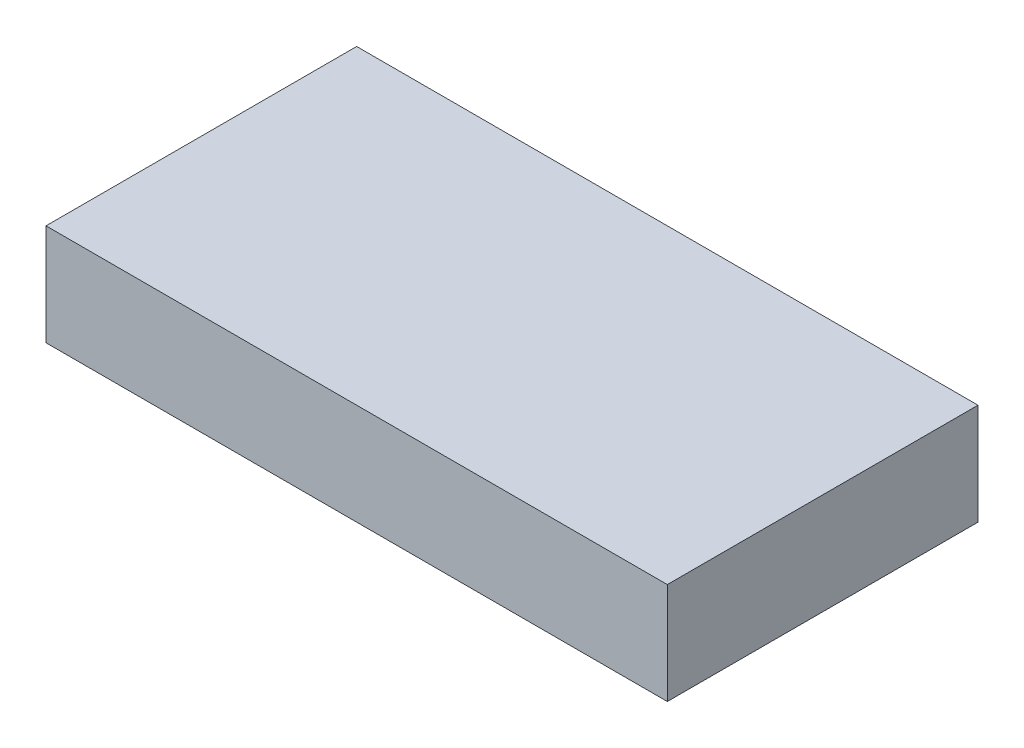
ISO-10303-21;
HEADER;
FILE_DESCRIPTION(('STEP AP214'),'2;1');
FILE_NAME('part.step','',(''),(''),'','','');
FILE_SCHEMA(('AUTOMOTIVE_DESIGN { 1 0 10303 214 1 1 1 1 }'));
ENDSEC;
DATA;
#1=APPLICATION_CONTEXT('core data for automotive mechanical design processes');
#2=APPLICATION_PROTOCOL_DEFINITION('international standard','automotive_design',2000,#1);
#3=PRODUCT_CONTEXT('',#1,'mechanical');
#4=PRODUCT('Part','Part','',(#3));
#5=PRODUCT_RELATED_PRODUCT_CATEGORY('part','',(#4));
#6=PRODUCT_DEFINITION_FORMATION('','',#4);
#7=PRODUCT_DEFINITION_CONTEXT('part definition',#1,'design');
#8=PRODUCT_DEFINITION('design','',#6,#7);
#9=PRODUCT_DEFINITION_SHAPE('','',#8);
#10=(LENGTH_UNIT() NAMED_UNIT(*) SI_UNIT(.MILLI.,.METRE.));
#11=(NAMED_UNIT(*) PLANE_ANGLE_UNIT() SI_UNIT($,.RADIAN.));
#12=(NAMED_UNIT(*) SI_UNIT($,.STERADIAN.) SOLID_ANGLE_UNIT());
#13=UNCERTAINTY_MEASURE_WITH_UNIT(LENGTH_MEASURE(1.E-05),#10,'distance_accuracy_value','');
#14=(GEOMETRIC_REPRESENTATION_CONTEXT(3) GLOBAL_UNCERTAINTY_ASSIGNED_CONTEXT((#13)) GLOBAL_UNIT_ASSIGNED_CONTEXT((#10,
#11,#12)) REPRESENTATION_CONTEXT('',''));
#15=CARTESIAN_POINT('',(0.,0.,0.));
#16=DIRECTION('',(0.,0.,1.));
#17=DIRECTION('',(1.,0.,0.));
#18=AXIS2_PLACEMENT_3D('',#15,#16,#17);
#19=CARTESIAN_POINT('',(115.,18.75,-57.5));
#20=DIRECTION('',(-1.,0.,0.));
#21=DIRECTION('',(0.,0.,1.));
#22=AXIS2_PLACEMENT_3D('',#19,#20,#21);
#23=PLANE('',#22);
#24=DIRECTION('',(0.,0.,-1.));
#25=VECTOR('',#24,1.);
#26=CARTESIAN_POINT('',(115.,-18.75,-57.5));
#27=LINE('',#26,#25);
#28=CARTESIAN_POINT('',(115.,-18.75,57.5));
#29=VERTEX_POINT('',#28);
#30=CARTESIAN_POINT('',(115.,-18.75,-57.5));
#31=VERTEX_POINT('',#30);
#32=EDGE_CURVE('E107',#29,#31,#27,.T.);
#33=ORIENTED_EDGE('',*,*,#32,.T.);
#34=DIRECTION('',(0.,-1.,0.));
#35=VECTOR('',#34,1.);
#36=CARTESIAN_POINT('',(115.,18.75,-57.5));
#37=LINE('',#36,#35);
#38=CARTESIAN_POINT('',(115.,18.75,-57.5));
#39=VERTEX_POINT('',#38);
#40=EDGE_CURVE('E11',#39,#31,#37,.T.);
#41=ORIENTED_EDGE('',*,*,#40,.F.);
#42=DIRECTION('',(0.,0.,-1.));
#43=VECTOR('',#42,1.);
#44=CARTESIAN_POINT('',(115.,18.75,-57.5));
#45=LINE('',#44,#43);
#46=CARTESIAN_POINT('',(115.,18.75,57.5));
#47=VERTEX_POINT('',#46);
#48=EDGE_CURVE('E91',#47,#39,#45,.T.);
#49=ORIENTED_EDGE('',*,*,#48,.F.);
#50=DIRECTION('',(0.,-1.,0.));
#51=VECTOR('',#50,1.);
#52=CARTESIAN_POINT('',(115.,18.75,57.5));
#53=LINE('',#52,#51);
#54=EDGE_CURVE('E103',#47,#29,#53,.T.);
#55=ORIENTED_EDGE('',*,*,#54,.T.);
#56=EDGE_LOOP('',(#33,#41,#49,#55));
#57=FACE_BOUND('',#56,.T.);
#58=ADVANCED_FACE('F39',(#57),#23,.F.);
#59=CARTESIAN_POINT('',(-115.,18.75,-57.5));
#60=DIRECTION('',(0.,0.,1.));
#61=DIRECTION('',(1.,0.,0.));
#62=AXIS2_PLACEMENT_3D('',#59,#60,#61);
#63=PLANE('',#62);
#64=DIRECTION('',(-1.,0.,0.));
#65=VECTOR('',#64,1.);
#66=CARTESIAN_POINT('',(-115.,-18.75,-57.5));
#67=LINE('',#66,#65);
#68=CARTESIAN_POINT('',(-115.,-18.75,-57.5));
#69=VERTEX_POINT('',#68);
#70=EDGE_CURVE('E96',#31,#69,#67,.T.);
#71=ORIENTED_EDGE('',*,*,#70,.T.);
#72=DIRECTION('',(0.,-1.,0.));
#73=VECTOR('',#72,1.);
#74=CARTESIAN_POINT('',(-115.,18.75,-57.5));
#75=LINE('',#74,#73);
#76=CARTESIAN_POINT('',(-115.,18.75,-57.5));
#77=VERTEX_POINT('',#76);
#78=EDGE_CURVE('E48',#77,#69,#75,.T.);
#79=ORIENTED_EDGE('',*,*,#78,.F.);
#80=DIRECTION('',(-1.,0.,0.));
#81=VECTOR('',#80,1.);
#82=CARTESIAN_POINT('',(-115.,18.75,-57.5));
#83=LINE('',#82,#81);
#84=EDGE_CURVE('E86',#39,#77,#83,.T.);
#85=ORIENTED_EDGE('',*,*,#84,.F.);
#86=ORIENTED_EDGE('',*,*,#40,.T.);
#87=EDGE_LOOP('',(#71,#79,#85,#86));
#88=FACE_BOUND('',#87,.T.);
#89=ADVANCED_FACE('F95',(#88),#63,.F.);
#90=CARTESIAN_POINT('',(-115.,18.75,-57.5));
#91=DIRECTION('',(1.,0.,0.));
#92=DIRECTION('',(0.,0.,-1.));
#93=AXIS2_PLACEMENT_3D('',#90,#91,#92);
#94=PLANE('',#93);
#95=DIRECTION('',(0.,0.,1.));
#96=VECTOR('',#95,1.);
#97=CARTESIAN_POINT('',(-115.,-18.75,-57.5));
#98=LINE('',#97,#96);
#99=CARTESIAN_POINT('',(-115.,-18.75,57.5));
#100=VERTEX_POINT('',#99);
#101=EDGE_CURVE('E73',#69,#100,#98,.T.);
#102=ORIENTED_EDGE('',*,*,#101,.T.);
#103=DIRECTION('',(0.,-1.,0.));
#104=VECTOR('',#103,1.);
#105=CARTESIAN_POINT('',(-115.,18.75,57.5));
#106=LINE('',#105,#104);
#107=CARTESIAN_POINT('',(-115.,18.75,57.5));
#108=VERTEX_POINT('',#107);
#109=EDGE_CURVE('E98',#108,#100,#106,.T.);
#110=ORIENTED_EDGE('',*,*,#109,.F.);
#111=DIRECTION('',(0.,0.,1.));
#112=VECTOR('',#111,1.);
#113=CARTESIAN_POINT('',(-115.,18.75,-57.5));
#114=LINE('',#113,#112);
#115=EDGE_CURVE('E89',#77,#108,#114,.T.);
#116=ORIENTED_EDGE('',*,*,#115,.F.);
#117=ORIENTED_EDGE('',*,*,#78,.T.);
#118=EDGE_LOOP('',(#102,#110,#116,#117));
#119=FACE_BOUND('',#118,.T.);
#120=ADVANCED_FACE('F99',(#119),#94,.F.);
#121=CARTESIAN_POINT('',(-115.,18.75,57.5));
#122=DIRECTION('',(0.,0.,-1.));
#123=DIRECTION('',(-1.,0.,0.));
#124=AXIS2_PLACEMENT_3D('',#121,#122,#123);
#125=PLANE('',#124);
#126=DIRECTION('',(1.,0.,0.));
#127=VECTOR('',#126,1.);
#128=CARTESIAN_POINT('',(-115.,-18.75,57.5));
#129=LINE('',#128,#127);
#130=EDGE_CURVE('E79',#100,#29,#129,.T.);
#131=ORIENTED_EDGE('',*,*,#130,.T.);
#132=ORIENTED_EDGE('',*,*,#54,.F.);
#133=DIRECTION('',(1.,0.,0.));
#134=VECTOR('',#133,1.);
#135=CARTESIAN_POINT('',(-115.,18.75,57.5));
#136=LINE('',#135,#134);
#137=EDGE_CURVE('E56',#108,#47,#136,.T.);
#138=ORIENTED_EDGE('',*,*,#137,.F.);
#139=ORIENTED_EDGE('',*,*,#109,.T.);
#140=EDGE_LOOP('',(#131,#132,#138,#139));
#141=FACE_BOUND('',#140,.T.);
#142=ADVANCED_FACE('F120',(#141),#125,.F.);
#143=CARTESIAN_POINT('',(0.,18.75,0.));
#144=DIRECTION('',(0.,1.,0.));
#145=DIRECTION('',(0.,0.,1.));
#146=AXIS2_PLACEMENT_3D('',#143,#144,#145);
#147=PLANE('',#146);
#148=ORIENTED_EDGE('',*,*,#48,.T.);
#149=ORIENTED_EDGE('',*,*,#84,.T.);
#150=ORIENTED_EDGE('',*,*,#115,.T.);
#151=ORIENTED_EDGE('',*,*,#137,.T.);
#152=EDGE_LOOP('',(#148,#149,#150,#151));
#153=FACE_BOUND('',#152,.T.);
#154=ADVANCED_FACE('F87',(#153),#147,.T.);
#155=CARTESIAN_POINT('',(0.,-18.75,0.));
#156=DIRECTION('',(0.,1.,0.));
#157=DIRECTION('',(0.,0.,1.));
#158=AXIS2_PLACEMENT_3D('',#155,#156,#157);
#159=PLANE('',#158);
#160=ORIENTED_EDGE('',*,*,#32,.F.);
#161=ORIENTED_EDGE('',*,*,#130,.F.);
#162=ORIENTED_EDGE('',*,*,#101,.F.);
#163=ORIENTED_EDGE('',*,*,#70,.F.);
#164=EDGE_LOOP('',(#160,#161,#162,#163));
#165=FACE_BOUND('',#164,.T.);
#166=ADVANCED_FACE('F123',(#165),#159,.F.);
#167=CLOSED_SHELL('',(#58,#89,#120,#142,#154,#166));
#168=MANIFOLD_SOLID_BREP('B2',#167);
#169=ADVANCED_BREP_SHAPE_REPRESENTATION('',(#18,#168),#14);
#170=SHAPE_DEFINITION_REPRESENTATION(#9,#169);
ENDSEC;
END-ISO-10303-21;
